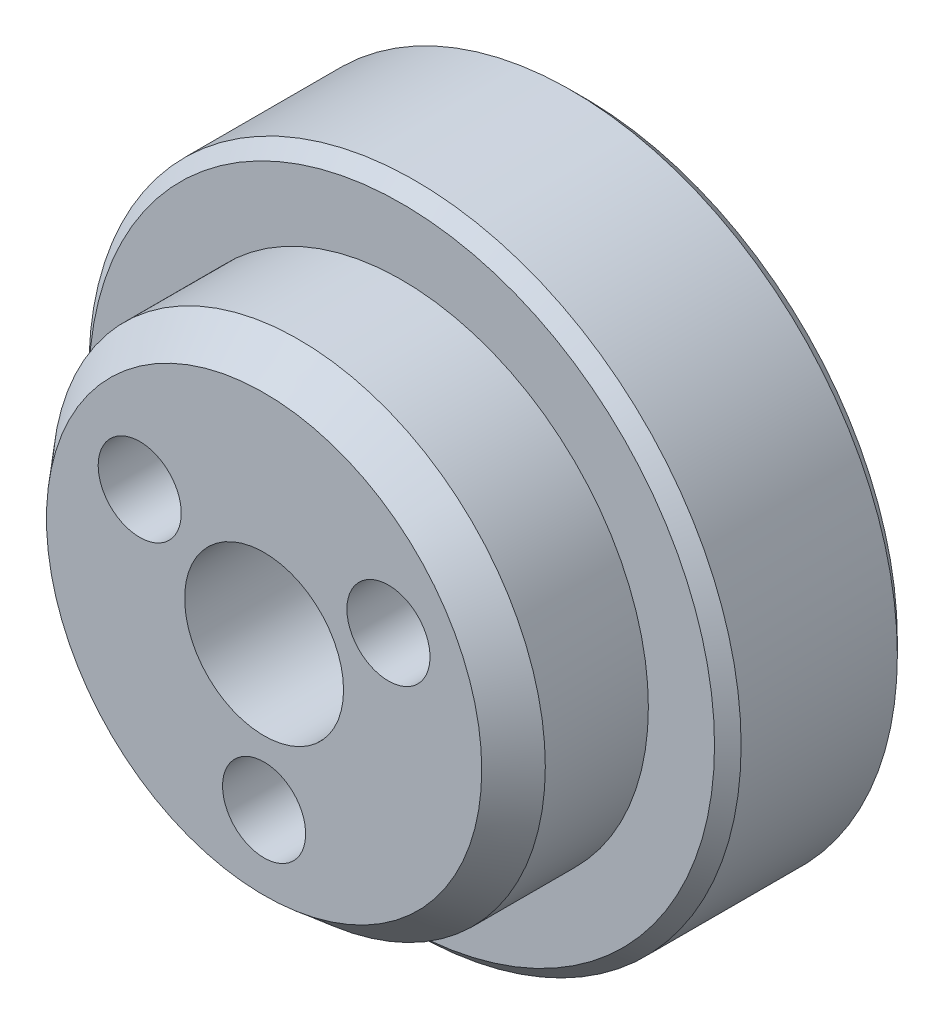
ISO-10303-21;
HEADER;
FILE_DESCRIPTION(('STEP AP214'),'2;1');
FILE_NAME('part.step','',(''),(''),'','','');
FILE_SCHEMA(('AUTOMOTIVE_DESIGN { 1 0 10303 214 1 1 1 1 }'));
ENDSEC;
DATA;
#1=APPLICATION_CONTEXT('core data for automotive mechanical design processes');
#2=APPLICATION_PROTOCOL_DEFINITION('international standard','automotive_design',2000,#1);
#3=PRODUCT_CONTEXT('',#1,'mechanical');
#4=PRODUCT('Part','Part','',(#3));
#5=PRODUCT_RELATED_PRODUCT_CATEGORY('part','',(#4));
#6=PRODUCT_DEFINITION_FORMATION('','',#4);
#7=PRODUCT_DEFINITION_CONTEXT('part definition',#1,'design');
#8=PRODUCT_DEFINITION('design','',#6,#7);
#9=PRODUCT_DEFINITION_SHAPE('','',#8);
#10=(LENGTH_UNIT() NAMED_UNIT(*) SI_UNIT(.MILLI.,.METRE.));
#11=(NAMED_UNIT(*) PLANE_ANGLE_UNIT() SI_UNIT($,.RADIAN.));
#12=(NAMED_UNIT(*) SI_UNIT($,.STERADIAN.) SOLID_ANGLE_UNIT());
#13=UNCERTAINTY_MEASURE_WITH_UNIT(LENGTH_MEASURE(1.E-05),#10,'distance_accuracy_value','');
#14=(GEOMETRIC_REPRESENTATION_CONTEXT(3) GLOBAL_UNCERTAINTY_ASSIGNED_CONTEXT((#13)) GLOBAL_UNIT_ASSIGNED_CONTEXT((#10,
#11,#12)) REPRESENTATION_CONTEXT('',''));
#15=CARTESIAN_POINT('',(0.,0.,0.));
#16=DIRECTION('',(0.,0.,1.));
#17=DIRECTION('',(1.,0.,0.));
#18=AXIS2_PLACEMENT_3D('',#15,#16,#17);
#19=CARTESIAN_POINT('',(0.,0.,12.2428));
#20=DIRECTION('',(0.,0.,-1.));
#21=DIRECTION('',(-1.,0.,0.));
#22=AXIS2_PLACEMENT_3D('',#19,#20,#21);
#23=CYLINDRICAL_SURFACE('',#22,12.4587);
#24=CARTESIAN_POINT('',(0.,0.,6.47699999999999));
#25=DIRECTION('',(0.,0.,1.));
#26=DIRECTION('',(1.,0.,0.));
#27=AXIS2_PLACEMENT_3D('',#24,#25,#26);
#28=CIRCLE('',#27,12.4587);
#29=CARTESIAN_POINT('',(12.4587,0.,6.47699999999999));
#30=VERTEX_POINT('',#29);
#31=EDGE_CURVE('E51',#30,#30,#28,.F.);
#32=ORIENTED_EDGE('',*,*,#31,.T.);
#33=EDGE_LOOP('',(#32));
#34=FACE_BOUND('',#33,.T.);
#35=CARTESIAN_POINT('',(0.,0.,0.508000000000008));
#36=DIRECTION('',(0.,0.,1.));
#37=DIRECTION('',(1.,0.,0.));
#38=AXIS2_PLACEMENT_3D('',#35,#36,#37);
#39=CIRCLE('',#38,12.4587);
#40=CARTESIAN_POINT('',(12.4587,0.,0.508000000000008));
#41=VERTEX_POINT('',#40);
#42=EDGE_CURVE('E55',#41,#41,#39,.T.);
#43=ORIENTED_EDGE('',*,*,#42,.T.);
#44=EDGE_LOOP('',(#43));
#45=FACE_BOUND('',#44,.T.);
#46=ADVANCED_FACE('F44',(#34,#45),#23,.T.);
#47=CARTESIAN_POINT('',(0.,0.,0.));
#48=DIRECTION('',(0.,0.,1.));
#49=DIRECTION('',(1.,0.,0.));
#50=AXIS2_PLACEMENT_3D('',#47,#48,#49);
#51=PLANE('',#50);
#52=CARTESIAN_POINT('',(0.,0.,0.));
#53=DIRECTION('',(0.,0.,1.));
#54=DIRECTION('',(1.,0.,0.));
#55=AXIS2_PLACEMENT_3D('',#52,#53,#54);
#56=CIRCLE('',#55,11.9507);
#57=CARTESIAN_POINT('',(11.9507,0.,0.));
#58=VERTEX_POINT('',#57);
#59=EDGE_CURVE('E13',#58,#58,#56,.F.);
#60=ORIENTED_EDGE('',*,*,#59,.T.);
#61=EDGE_LOOP('',(#60));
#62=FACE_BOUND('',#61,.T.);
#63=CARTESIAN_POINT('',(4.75136177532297,2.74319999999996,0.));
#64=DIRECTION('',(0.,0.,-1.));
#65=DIRECTION('',(0.499999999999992,-0.866025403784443,0.));
#66=AXIS2_PLACEMENT_3D('',#63,#64,#65);
#67=CIRCLE('',#66,1.5875);
#68=CARTESIAN_POINT('',(5.54511177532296,1.36838467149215,0.));
#69=VERTEX_POINT('',#68);
#70=EDGE_CURVE('E104',#69,#69,#67,.T.);
#71=ORIENTED_EDGE('',*,*,#70,.F.);
#72=EDGE_LOOP('',(#71));
#73=FACE_BOUND('',#72,.T.);
#74=CARTESIAN_POINT('',(-4.75136177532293,2.74320000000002,0.));
#75=DIRECTION('',(0.,0.,-1.));
#76=DIRECTION('',(0.500000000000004,0.866025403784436,0.));
#77=AXIS2_PLACEMENT_3D('',#74,#75,#76);
#78=CIRCLE('',#77,1.5875);
#79=CARTESIAN_POINT('',(-3.95761177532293,4.11801532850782,0.));
#80=VERTEX_POINT('',#79);
#81=EDGE_CURVE('E98',#80,#80,#78,.T.);
#82=ORIENTED_EDGE('',*,*,#81,.F.);
#83=EDGE_LOOP('',(#82));
#84=FACE_BOUND('',#83,.T.);
#85=CARTESIAN_POINT('',(0.,-5.4864,0.));
#86=DIRECTION('',(0.,0.,-1.));
#87=DIRECTION('',(-1.,0.,0.));
#88=AXIS2_PLACEMENT_3D('',#85,#86,#87);
#89=CIRCLE('',#88,1.5875);
#90=CARTESIAN_POINT('',(-1.5875,-5.4864,0.));
#91=VERTEX_POINT('',#90);
#92=EDGE_CURVE('E92',#91,#91,#89,.T.);
#93=ORIENTED_EDGE('',*,*,#92,.F.);
#94=EDGE_LOOP('',(#93));
#95=FACE_BOUND('',#94,.T.);
#96=CARTESIAN_POINT('',(0.,7.0104,0.));
#97=DIRECTION('',(0.,0.,-1.));
#98=DIRECTION('',(-1.,0.,0.));
#99=AXIS2_PLACEMENT_3D('',#96,#97,#98);
#100=CIRCLE('',#99,1.6002);
#101=CARTESIAN_POINT('',(-1.6002,7.0104,0.));
#102=VERTEX_POINT('',#101);
#103=EDGE_CURVE('E86',#102,#102,#100,.T.);
#104=ORIENTED_EDGE('',*,*,#103,.F.);
#105=EDGE_LOOP('',(#104));
#106=FACE_BOUND('',#105,.T.);
#107=CARTESIAN_POINT('',(0.,0.,0.));
#108=DIRECTION('',(0.,0.,-1.));
#109=DIRECTION('',(-1.,0.,0.));
#110=AXIS2_PLACEMENT_3D('',#107,#108,#109);
#111=CIRCLE('',#110,1.1684);
#112=CARTESIAN_POINT('',(-1.1684,0.,0.));
#113=VERTEX_POINT('',#112);
#114=EDGE_CURVE('E69',#113,#113,#111,.T.);
#115=ORIENTED_EDGE('',*,*,#114,.F.);
#116=EDGE_LOOP('',(#115));
#117=FACE_BOUND('',#116,.T.);
#118=ADVANCED_FACE('F121',(#62,#73,#84,#95,#106,#117),#51,.F.);
#119=CARTESIAN_POINT('',(0.,0.,6.985));
#120=DIRECTION('',(0.,0.,1.));
#121=DIRECTION('',(1.,0.,0.));
#122=AXIS2_PLACEMENT_3D('',#119,#120,#121);
#123=PLANE('',#122);
#124=CARTESIAN_POINT('',(0.,0.,6.985));
#125=DIRECTION('',(0.,0.,1.));
#126=DIRECTION('',(1.,0.,0.));
#127=AXIS2_PLACEMENT_3D('',#124,#125,#126);
#128=CIRCLE('',#127,11.9507);
#129=CARTESIAN_POINT('',(11.9507,0.,6.985));
#130=VERTEX_POINT('',#129);
#131=EDGE_CURVE('E59',#130,#130,#128,.T.);
#132=ORIENTED_EDGE('',*,*,#131,.T.);
#133=EDGE_LOOP('',(#132));
#134=FACE_BOUND('',#133,.T.);
#135=CARTESIAN_POINT('',(0.,0.,6.985));
#136=DIRECTION('',(0.,0.,1.));
#137=DIRECTION('',(1.,0.,0.));
#138=AXIS2_PLACEMENT_3D('',#135,#136,#137);
#139=CIRCLE('',#138,9.4234);
#140=CARTESIAN_POINT('',(9.4234,0.,6.985));
#141=VERTEX_POINT('',#140);
#142=EDGE_CURVE('E75',#141,#141,#139,.T.);
#143=ORIENTED_EDGE('',*,*,#142,.F.);
#144=EDGE_LOOP('',(#143));
#145=FACE_BOUND('',#144,.T.);
#146=ADVANCED_FACE('F124',(#134,#145),#123,.T.);
#147=CARTESIAN_POINT('',(0.,0.,6.985));
#148=DIRECTION('',(0.,0.,1.));
#149=DIRECTION('',(1.,0.,0.));
#150=AXIS2_PLACEMENT_3D('',#147,#148,#149);
#151=CYLINDRICAL_SURFACE('',#150,9.4234);
#152=CARTESIAN_POINT('',(0.,0.,10.922));
#153=DIRECTION('',(0.,0.,1.));
#154=DIRECTION('',(1.,0.,0.));
#155=AXIS2_PLACEMENT_3D('',#152,#153,#154);
#156=CIRCLE('',#155,9.4234);
#157=CARTESIAN_POINT('',(9.4234,0.,10.922));
#158=VERTEX_POINT('',#157);
#159=EDGE_CURVE('E64',#158,#158,#156,.F.);
#160=ORIENTED_EDGE('',*,*,#159,.T.);
#161=EDGE_LOOP('',(#160));
#162=FACE_BOUND('',#161,.T.);
#163=ORIENTED_EDGE('',*,*,#142,.T.);
#164=EDGE_LOOP('',(#163));
#165=FACE_BOUND('',#164,.T.);
#166=ADVANCED_FACE('F171',(#162,#165),#151,.T.);
#167=CARTESIAN_POINT('',(0.,0.,12.2428));
#168=DIRECTION('',(0.,0.,1.));
#169=DIRECTION('',(1.,0.,0.));
#170=AXIS2_PLACEMENT_3D('',#167,#168,#169);
#171=PLANE('',#170);
#172=CARTESIAN_POINT('',(4.75136177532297,2.74319999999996,12.2428));
#173=DIRECTION('',(0.,0.,-1.));
#174=DIRECTION('',(0.499999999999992,-0.866025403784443,0.));
#175=AXIS2_PLACEMENT_3D('',#172,#173,#174);
#176=CIRCLE('',#175,1.5875);
#177=CARTESIAN_POINT('',(5.54511177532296,1.36838467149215,12.2428));
#178=VERTEX_POINT('',#177);
#179=EDGE_CURVE('E101',#178,#178,#176,.T.);
#180=ORIENTED_EDGE('',*,*,#179,.T.);
#181=EDGE_LOOP('',(#180));
#182=FACE_BOUND('',#181,.T.);
#183=CARTESIAN_POINT('',(-4.75136177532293,2.74320000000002,12.2428));
#184=DIRECTION('',(0.,0.,-1.));
#185=DIRECTION('',(0.500000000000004,0.866025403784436,0.));
#186=AXIS2_PLACEMENT_3D('',#183,#184,#185);
#187=CIRCLE('',#186,1.5875);
#188=CARTESIAN_POINT('',(-3.95761177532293,4.11801532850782,12.2428));
#189=VERTEX_POINT('',#188);
#190=EDGE_CURVE('E95',#189,#189,#187,.T.);
#191=ORIENTED_EDGE('',*,*,#190,.T.);
#192=EDGE_LOOP('',(#191));
#193=FACE_BOUND('',#192,.T.);
#194=CARTESIAN_POINT('',(0.,-5.4864,12.2428));
#195=DIRECTION('',(0.,0.,-1.));
#196=DIRECTION('',(-1.,0.,0.));
#197=AXIS2_PLACEMENT_3D('',#194,#195,#196);
#198=CIRCLE('',#197,1.5875);
#199=CARTESIAN_POINT('',(-1.5875,-5.4864,12.2428));
#200=VERTEX_POINT('',#199);
#201=EDGE_CURVE('E89',#200,#200,#198,.T.);
#202=ORIENTED_EDGE('',*,*,#201,.T.);
#203=EDGE_LOOP('',(#202));
#204=FACE_BOUND('',#203,.T.);
#205=CARTESIAN_POINT('',(0.,0.,12.2428));
#206=DIRECTION('',(0.,0.,1.));
#207=DIRECTION('',(1.,0.,0.));
#208=AXIS2_PLACEMENT_3D('',#205,#206,#207);
#209=CIRCLE('',#208,3.0353);
#210=CARTESIAN_POINT('',(3.0353,0.,12.2428));
#211=VERTEX_POINT('',#210);
#212=EDGE_CURVE('E68',#211,#211,#209,.T.);
#213=ORIENTED_EDGE('',*,*,#212,.F.);
#214=EDGE_LOOP('',(#213));
#215=FACE_BOUND('',#214,.T.);
#216=CARTESIAN_POINT('',(0.,0.,12.2428));
#217=DIRECTION('',(0.,0.,1.));
#218=DIRECTION('',(1.,0.,0.));
#219=AXIS2_PLACEMENT_3D('',#216,#217,#218);
#220=CIRCLE('',#219,8.31511720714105);
#221=CARTESIAN_POINT('',(8.31511720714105,0.,12.2428));
#222=VERTEX_POINT('',#221);
#223=EDGE_CURVE('E72',#222,#222,#220,.T.);
#224=ORIENTED_EDGE('',*,*,#223,.T.);
#225=EDGE_LOOP('',(#224));
#226=FACE_BOUND('',#225,.T.);
#227=ADVANCED_FACE('F110',(#182,#193,#204,#215,#226),#171,.T.);
#228=CARTESIAN_POINT('',(0.,0.,12.2428));
#229=DIRECTION('',(0.,0.,-1.));
#230=DIRECTION('',(-1.,0.,0.));
#231=AXIS2_PLACEMENT_3D('',#228,#229,#230);
#232=CONICAL_SURFACE('',#231,8.31511720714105,0.698131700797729);
#233=ORIENTED_EDGE('',*,*,#159,.F.);
#234=EDGE_LOOP('',(#233));
#235=FACE_BOUND('',#234,.T.);
#236=ORIENTED_EDGE('',*,*,#223,.F.);
#237=EDGE_LOOP('',(#236));
#238=FACE_BOUND('',#237,.T.);
#239=ADVANCED_FACE('F157',(#235,#238),#232,.T.);
#240=CARTESIAN_POINT('',(0.,0.,1.5748));
#241=DIRECTION('',(0.,0.,1.));
#242=DIRECTION('',(1.,0.,0.));
#243=AXIS2_PLACEMENT_3D('',#240,#241,#242);
#244=CYLINDRICAL_SURFACE('',#243,3.0353);
#245=CARTESIAN_POINT('',(0.,0.,1.5748));
#246=DIRECTION('',(0.,0.,1.));
#247=DIRECTION('',(1.,0.,0.));
#248=AXIS2_PLACEMENT_3D('',#245,#246,#247);
#249=CIRCLE('',#248,3.0353);
#250=CARTESIAN_POINT('',(3.0353,0.,1.5748));
#251=VERTEX_POINT('',#250);
#252=EDGE_CURVE('E78',#251,#251,#249,.T.);
#253=ORIENTED_EDGE('',*,*,#252,.F.);
#254=EDGE_LOOP('',(#253));
#255=FACE_BOUND('',#254,.T.);
#256=ORIENTED_EDGE('',*,*,#212,.T.);
#257=EDGE_LOOP('',(#256));
#258=FACE_BOUND('',#257,.T.);
#259=ADVANCED_FACE('F147',(#255,#258),#244,.F.);
#260=CARTESIAN_POINT('',(0.,0.,1.5748));
#261=DIRECTION('',(0.,0.,1.));
#262=DIRECTION('',(1.,0.,0.));
#263=AXIS2_PLACEMENT_3D('',#260,#261,#262);
#264=PLANE('',#263);
#265=CARTESIAN_POINT('',(0.,0.,1.5748));
#266=DIRECTION('',(0.,0.,1.));
#267=DIRECTION('',(1.,0.,0.));
#268=AXIS2_PLACEMENT_3D('',#265,#266,#267);
#269=CIRCLE('',#268,1.1684);
#270=CARTESIAN_POINT('',(-1.1684,0.,1.5748));
#271=VERTEX_POINT('',#270);
#272=EDGE_CURVE('E65',#271,#271,#269,.T.);
#273=ORIENTED_EDGE('',*,*,#272,.F.);
#274=EDGE_LOOP('',(#273));
#275=FACE_BOUND('',#274,.T.);
#276=ORIENTED_EDGE('',*,*,#252,.T.);
#277=EDGE_LOOP('',(#276));
#278=FACE_BOUND('',#277,.T.);
#279=ADVANCED_FACE('F137',(#275,#278),#264,.T.);
#280=CARTESIAN_POINT('',(0.,0.,3.048));
#281=DIRECTION('',(0.,0.,-1.));
#282=DIRECTION('',(-1.,0.,0.));
#283=AXIS2_PLACEMENT_3D('',#280,#281,#282);
#284=CYLINDRICAL_SURFACE('',#283,1.1684);
#285=CARTESIAN_POINT('',(-1.1684,0.,1.5748));
#286=CARTESIAN_POINT('',(-1.1684,0.,1.55839583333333));
#287=CARTESIAN_POINT('',(-1.1684,0.,1.54199166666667));
#288=CARTESIAN_POINT('',(-1.1684,0.,1.50918333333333));
#289=CARTESIAN_POINT('',(-1.1684,0.,1.49277916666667));
#290=CARTESIAN_POINT('',(-1.1684,0.,1.45997083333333));
#291=CARTESIAN_POINT('',(-1.1684,0.,1.44356666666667));
#292=CARTESIAN_POINT('',(-1.1684,0.,1.41075833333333));
#293=CARTESIAN_POINT('',(-1.1684,0.,1.39435416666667));
#294=CARTESIAN_POINT('',(-1.1684,0.,1.36154583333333));
#295=CARTESIAN_POINT('',(-1.1684,0.,1.34514166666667));
#296=CARTESIAN_POINT('',(-1.1684,0.,1.31233333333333));
#297=CARTESIAN_POINT('',(-1.1684,0.,1.29592916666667));
#298=CARTESIAN_POINT('',(-1.1684,0.,1.26312083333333));
#299=CARTESIAN_POINT('',(-1.1684,0.,1.24671666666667));
#300=CARTESIAN_POINT('',(-1.1684,0.,1.21390833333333));
#301=CARTESIAN_POINT('',(-1.1684,0.,1.19750416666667));
#302=CARTESIAN_POINT('',(-1.1684,0.,1.16469583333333));
#303=CARTESIAN_POINT('',(-1.1684,0.,1.14829166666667));
#304=CARTESIAN_POINT('',(-1.1684,0.,1.11548333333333));
#305=CARTESIAN_POINT('',(-1.1684,0.,1.09907916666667));
#306=CARTESIAN_POINT('',(-1.1684,0.,1.06627083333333));
#307=CARTESIAN_POINT('',(-1.1684,0.,1.04986666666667));
#308=CARTESIAN_POINT('',(-1.1684,0.,1.01705833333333));
#309=CARTESIAN_POINT('',(-1.1684,0.,1.00065416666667));
#310=CARTESIAN_POINT('',(-1.1684,0.,0.967845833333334));
#311=CARTESIAN_POINT('',(-1.1684,0.,0.951441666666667));
#312=CARTESIAN_POINT('',(-1.1684,0.,0.918633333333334));
#313=CARTESIAN_POINT('',(-1.1684,0.,0.902229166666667));
#314=CARTESIAN_POINT('',(-1.1684,0.,0.869420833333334));
#315=CARTESIAN_POINT('',(-1.1684,0.,0.853016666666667));
#316=CARTESIAN_POINT('',(-1.1684,0.,0.820208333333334));
#317=CARTESIAN_POINT('',(-1.1684,0.,0.803804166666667));
#318=CARTESIAN_POINT('',(-1.1684,0.,0.770995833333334));
#319=CARTESIAN_POINT('',(-1.1684,0.,0.754591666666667));
#320=CARTESIAN_POINT('',(-1.1684,0.,0.721783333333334));
#321=CARTESIAN_POINT('',(-1.1684,0.,0.705379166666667));
#322=CARTESIAN_POINT('',(-1.1684,0.,0.672570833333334));
#323=CARTESIAN_POINT('',(-1.1684,0.,0.656166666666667));
#324=CARTESIAN_POINT('',(-1.1684,0.,0.623358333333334));
#325=CARTESIAN_POINT('',(-1.1684,0.,0.606954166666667));
#326=CARTESIAN_POINT('',(-1.1684,0.,0.574145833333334));
#327=CARTESIAN_POINT('',(-1.1684,0.,0.557741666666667));
#328=CARTESIAN_POINT('',(-1.1684,0.,0.524933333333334));
#329=CARTESIAN_POINT('',(-1.1684,0.,0.508529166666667));
#330=CARTESIAN_POINT('',(-1.1684,0.,0.475720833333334));
#331=CARTESIAN_POINT('',(-1.1684,0.,0.459316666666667));
#332=CARTESIAN_POINT('',(-1.1684,0.,0.426508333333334));
#333=CARTESIAN_POINT('',(-1.1684,0.,0.410104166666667));
#334=CARTESIAN_POINT('',(-1.1684,0.,0.377295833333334));
#335=CARTESIAN_POINT('',(-1.1684,0.,0.360891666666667));
#336=CARTESIAN_POINT('',(-1.1684,0.,0.328083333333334));
#337=CARTESIAN_POINT('',(-1.1684,0.,0.311679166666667));
#338=CARTESIAN_POINT('',(-1.1684,0.,0.278870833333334));
#339=CARTESIAN_POINT('',(-1.1684,0.,0.262466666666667));
#340=CARTESIAN_POINT('',(-1.1684,0.,0.229658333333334));
#341=CARTESIAN_POINT('',(-1.1684,0.,0.213254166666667));
#342=CARTESIAN_POINT('',(-1.1684,0.,0.180445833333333));
#343=CARTESIAN_POINT('',(-1.1684,0.,0.164041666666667));
#344=CARTESIAN_POINT('',(-1.1684,0.,0.131233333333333));
#345=CARTESIAN_POINT('',(-1.1684,0.,0.114829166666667));
#346=CARTESIAN_POINT('',(-1.1684,0.,0.0820208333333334));
#347=CARTESIAN_POINT('',(-1.1684,0.,0.0656166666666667));
#348=CARTESIAN_POINT('',(-1.1684,0.,0.0328083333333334));
#349=CARTESIAN_POINT('',(-1.1684,0.,0.0164041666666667));
#350=CARTESIAN_POINT('',(-1.1684,0.,0.));
#351=B_SPLINE_CURVE_WITH_KNOTS('',3,(#285,#286,#287,#288,#289,#290,#291,#292,#293,#294,#295,
#296,#297,#298,#299,#300,#301,#302,#303,#304,#305,#306,#307,#308,#309,#310,#311,#312,#313,#314,
#315,#316,#317,#318,#319,#320,#321,#322,#323,#324,#325,#326,#327,#328,#329,#330,#331,#332,#333,
#334,#335,#336,#337,#338,#339,#340,#341,#342,#343,#344,#345,#346,#347,#348,#349,#350),
.UNSPECIFIED.,.F.,.F.,(4,2,2,2,2,2,2,2,2,2,2,2,2,2,2,2,2,2,2,2,2,2,2,2,2,2,2,2,2,2,2,2,4),(0.,
0.0492125,0.0984250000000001,0.1476375,0.19685,0.2460625,0.295275,0.3444875,0.3937,0.4429125,
0.492125,0.5413375,0.59055,0.6397625,0.688975,0.7381875,0.7874,0.8366125,0.885825,
0.935037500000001,0.984250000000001,1.0334625,1.082675,1.1318875,1.1811,1.2303125,1.279525,
1.3287375,1.37795,1.4271625,1.476375,1.5255875,1.5748),.UNSPECIFIED.);
#352=EDGE_CURVE('BSEAM134',#271,#113,#351,.T.);
#353=ORIENTED_EDGE('',*,*,#272,.T.);
#354=ORIENTED_EDGE('',*,*,#114,.T.);
#355=ORIENTED_EDGE('',*,*,#352,.T.);
#356=ORIENTED_EDGE('',*,*,#352,.F.);
#357=EDGE_LOOP('',(#353,#355,#354,#356));
#358=FACE_BOUND('',#357,.T.);
#359=ADVANCED_FACE('F134',(#358),#284,.F.);
#360=CARTESIAN_POINT('',(0.,7.0104,3.048));
#361=DIRECTION('',(0.,0.,-1.));
#362=DIRECTION('',(-1.,0.,0.));
#363=AXIS2_PLACEMENT_3D('',#360,#361,#362);
#364=CYLINDRICAL_SURFACE('',#363,1.6002);
#365=CARTESIAN_POINT('',(0.,7.0104,3.048));
#366=DIRECTION('',(0.,0.,-1.));
#367=DIRECTION('',(-1.,0.,0.));
#368=AXIS2_PLACEMENT_3D('',#365,#366,#367);
#369=CIRCLE('',#368,1.6002);
#370=CARTESIAN_POINT('',(-1.6002,7.0104,3.048));
#371=VERTEX_POINT('',#370);
#372=EDGE_CURVE('E85',#371,#371,#369,.T.);
#373=CARTESIAN_POINT('',(-1.6002,7.0104,3.048));
#374=CARTESIAN_POINT('',(-1.6002,7.0104,3.01625));
#375=CARTESIAN_POINT('',(-1.6002,7.0104,2.9845));
#376=CARTESIAN_POINT('',(-1.6002,7.0104,2.921));
#377=CARTESIAN_POINT('',(-1.6002,7.0104,2.88925));
#378=CARTESIAN_POINT('',(-1.6002,7.0104,2.82575));
#379=CARTESIAN_POINT('',(-1.6002,7.0104,2.794));
#380=CARTESIAN_POINT('',(-1.6002,7.0104,2.7305));
#381=CARTESIAN_POINT('',(-1.6002,7.0104,2.69875));
#382=CARTESIAN_POINT('',(-1.6002,7.0104,2.63525));
#383=CARTESIAN_POINT('',(-1.6002,7.0104,2.6035));
#384=CARTESIAN_POINT('',(-1.6002,7.0104,2.54));
#385=CARTESIAN_POINT('',(-1.6002,7.0104,2.50825));
#386=CARTESIAN_POINT('',(-1.6002,7.0104,2.44475));
#387=CARTESIAN_POINT('',(-1.6002,7.0104,2.413));
#388=CARTESIAN_POINT('',(-1.6002,7.0104,2.3495));
#389=CARTESIAN_POINT('',(-1.6002,7.0104,2.31775));
#390=CARTESIAN_POINT('',(-1.6002,7.0104,2.25425));
#391=CARTESIAN_POINT('',(-1.6002,7.0104,2.2225));
#392=CARTESIAN_POINT('',(-1.6002,7.0104,2.159));
#393=CARTESIAN_POINT('',(-1.6002,7.0104,2.12725));
#394=CARTESIAN_POINT('',(-1.6002,7.0104,2.06375));
#395=CARTESIAN_POINT('',(-1.6002,7.0104,2.032));
#396=CARTESIAN_POINT('',(-1.6002,7.0104,1.9685));
#397=CARTESIAN_POINT('',(-1.6002,7.0104,1.93675));
#398=CARTESIAN_POINT('',(-1.6002,7.0104,1.87325));
#399=CARTESIAN_POINT('',(-1.6002,7.0104,1.8415));
#400=CARTESIAN_POINT('',(-1.6002,7.0104,1.778));
#401=CARTESIAN_POINT('',(-1.6002,7.0104,1.74625));
#402=CARTESIAN_POINT('',(-1.6002,7.0104,1.68275));
#403=CARTESIAN_POINT('',(-1.6002,7.0104,1.651));
#404=CARTESIAN_POINT('',(-1.6002,7.0104,1.5875));
#405=CARTESIAN_POINT('',(-1.6002,7.0104,1.55575));
#406=CARTESIAN_POINT('',(-1.6002,7.0104,1.49225));
#407=CARTESIAN_POINT('',(-1.6002,7.0104,1.4605));
#408=CARTESIAN_POINT('',(-1.6002,7.0104,1.397));
#409=CARTESIAN_POINT('',(-1.6002,7.0104,1.36525));
#410=CARTESIAN_POINT('',(-1.6002,7.0104,1.30175));
#411=CARTESIAN_POINT('',(-1.6002,7.0104,1.27));
#412=CARTESIAN_POINT('',(-1.6002,7.0104,1.2065));
#413=CARTESIAN_POINT('',(-1.6002,7.0104,1.17475));
#414=CARTESIAN_POINT('',(-1.6002,7.0104,1.11125));
#415=CARTESIAN_POINT('',(-1.6002,7.0104,1.0795));
#416=CARTESIAN_POINT('',(-1.6002,7.0104,1.016));
#417=CARTESIAN_POINT('',(-1.6002,7.0104,0.98425));
#418=CARTESIAN_POINT('',(-1.6002,7.0104,0.92075));
#419=CARTESIAN_POINT('',(-1.6002,7.0104,0.889));
#420=CARTESIAN_POINT('',(-1.6002,7.0104,0.8255));
#421=CARTESIAN_POINT('',(-1.6002,7.0104,0.79375));
#422=CARTESIAN_POINT('',(-1.6002,7.0104,0.73025));
#423=CARTESIAN_POINT('',(-1.6002,7.0104,0.6985));
#424=CARTESIAN_POINT('',(-1.6002,7.0104,0.635));
#425=CARTESIAN_POINT('',(-1.6002,7.0104,0.60325));
#426=CARTESIAN_POINT('',(-1.6002,7.0104,0.53975));
#427=CARTESIAN_POINT('',(-1.6002,7.0104,0.508));
#428=CARTESIAN_POINT('',(-1.6002,7.0104,0.4445));
#429=CARTESIAN_POINT('',(-1.6002,7.0104,0.41275));
#430=CARTESIAN_POINT('',(-1.6002,7.0104,0.34925));
#431=CARTESIAN_POINT('',(-1.6002,7.0104,0.3175));
#432=CARTESIAN_POINT('',(-1.6002,7.0104,0.254));
#433=CARTESIAN_POINT('',(-1.6002,7.0104,0.22225));
#434=CARTESIAN_POINT('',(-1.6002,7.0104,0.15875));
#435=CARTESIAN_POINT('',(-1.6002,7.0104,0.127));
#436=CARTESIAN_POINT('',(-1.6002,7.0104,0.0634999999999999));
#437=CARTESIAN_POINT('',(-1.6002,7.0104,0.03175));
#438=CARTESIAN_POINT('',(-1.6002,7.0104,0.));
#439=B_SPLINE_CURVE_WITH_KNOTS('',3,(#373,#374,#375,#376,#377,#378,#379,#380,#381,#382,#383,
#384,#385,#386,#387,#388,#389,#390,#391,#392,#393,#394,#395,#396,#397,#398,#399,#400,#401,#402,
#403,#404,#405,#406,#407,#408,#409,#410,#411,#412,#413,#414,#415,#416,#417,#418,#419,#420,#421,
#422,#423,#424,#425,#426,#427,#428,#429,#430,#431,#432,#433,#434,#435,#436,#437,#438),
.UNSPECIFIED.,.F.,.F.,(4,2,2,2,2,2,2,2,2,2,2,2,2,2,2,2,2,2,2,2,2,2,2,2,2,2,2,2,2,2,2,2,4),(0.,
0.0952499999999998,0.1905,0.28575,0.381,0.47625,0.5715,0.66675,0.762,0.85725,0.9525,1.04775,
1.143,1.23825,1.3335,1.42875,1.524,1.61925,1.7145,1.80975,1.905,2.00025,2.0955,2.19075,2.286,
2.38125,2.4765,2.57175,2.667,2.76225,2.8575,2.95275,3.048),.UNSPECIFIED.);
#440=EDGE_CURVE('BSEAM136',#371,#102,#439,.T.);
#441=ORIENTED_EDGE('',*,*,#372,.F.);
#442=ORIENTED_EDGE('',*,*,#103,.T.);
#443=ORIENTED_EDGE('',*,*,#440,.T.);
#444=ORIENTED_EDGE('',*,*,#440,.F.);
#445=EDGE_LOOP('',(#441,#443,#442,#444));
#446=FACE_BOUND('',#445,.T.);
#447=ADVANCED_FACE('F136',(#446),#364,.F.);
#448=CARTESIAN_POINT('',(0.,7.0104,3.048));
#449=DIRECTION('',(0.,0.,-1.));
#450=DIRECTION('',(-1.,0.,0.));
#451=AXIS2_PLACEMENT_3D('',#448,#449,#450);
#452=PLANE('',#451);
#453=ORIENTED_EDGE('',*,*,#372,.T.);
#454=EDGE_LOOP('',(#453));
#455=FACE_BOUND('',#454,.T.);
#456=ADVANCED_FACE('F144',(#455),#452,.T.);
#457=CARTESIAN_POINT('',(0.,-5.4864,12.2428));
#458=DIRECTION('',(0.,0.,-1.));
#459=DIRECTION('',(-1.,0.,0.));
#460=AXIS2_PLACEMENT_3D('',#457,#458,#459);
#461=CYLINDRICAL_SURFACE('',#460,1.5875);
#462=ORIENTED_EDGE('',*,*,#201,.F.);
#463=EDGE_LOOP('',(#462));
#464=FACE_BOUND('',#463,.T.);
#465=ORIENTED_EDGE('',*,*,#92,.T.);
#466=EDGE_LOOP('',(#465));
#467=FACE_BOUND('',#466,.T.);
#468=ADVANCED_FACE('F219',(#464,#467),#461,.F.);
#469=CARTESIAN_POINT('',(-4.75136177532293,2.74320000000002,12.2428));
#470=DIRECTION('',(0.,0.,-1.));
#471=DIRECTION('',(-1.,0.,0.));
#472=AXIS2_PLACEMENT_3D('',#469,#470,#471);
#473=CYLINDRICAL_SURFACE('',#472,1.5875);
#474=ORIENTED_EDGE('',*,*,#190,.F.);
#475=EDGE_LOOP('',(#474));
#476=FACE_BOUND('',#475,.T.);
#477=ORIENTED_EDGE('',*,*,#81,.T.);
#478=EDGE_LOOP('',(#477));
#479=FACE_BOUND('',#478,.T.);
#480=ADVANCED_FACE('F117',(#476,#479),#473,.F.);
#481=CARTESIAN_POINT('',(4.75136177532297,2.74319999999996,12.2428));
#482=DIRECTION('',(0.,0.,-1.));
#483=DIRECTION('',(-1.,0.,0.));
#484=AXIS2_PLACEMENT_3D('',#481,#482,#483);
#485=CYLINDRICAL_SURFACE('',#484,1.5875);
#486=ORIENTED_EDGE('',*,*,#179,.F.);
#487=EDGE_LOOP('',(#486));
#488=FACE_BOUND('',#487,.T.);
#489=ORIENTED_EDGE('',*,*,#70,.T.);
#490=EDGE_LOOP('',(#489));
#491=FACE_BOUND('',#490,.T.);
#492=ADVANCED_FACE('F113',(#488,#491),#485,.F.);
#493=CARTESIAN_POINT('',(0.,0.,6.985));
#494=DIRECTION('',(0.,0.,-1.));
#495=DIRECTION('',(-1.,0.,0.));
#496=AXIS2_PLACEMENT_3D('',#493,#494,#495);
#497=CONICAL_SURFACE('',#496,11.9507,0.785398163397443);
#498=ORIENTED_EDGE('',*,*,#31,.F.);
#499=EDGE_LOOP('',(#498));
#500=FACE_BOUND('',#499,.T.);
#501=ORIENTED_EDGE('',*,*,#131,.F.);
#502=EDGE_LOOP('',(#501));
#503=FACE_BOUND('',#502,.T.);
#504=ADVANCED_FACE('F116',(#500,#503),#497,.T.);
#505=CARTESIAN_POINT('',(0.,0.,0.508000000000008));
#506=DIRECTION('',(0.,0.,1.));
#507=DIRECTION('',(1.,0.,0.));
#508=AXIS2_PLACEMENT_3D('',#505,#506,#507);
#509=CONICAL_SURFACE('',#508,12.4587,0.785398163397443);
#510=ORIENTED_EDGE('',*,*,#59,.F.);
#511=EDGE_LOOP('',(#510));
#512=FACE_BOUND('',#511,.T.);
#513=ORIENTED_EDGE('',*,*,#42,.F.);
#514=EDGE_LOOP('',(#513));
#515=FACE_BOUND('',#514,.T.);
#516=ADVANCED_FACE('F46',(#512,#515),#509,.T.);
#517=CLOSED_SHELL('',(#46,#118,#146,#166,#227,#239,#259,#279,#359,#447,#456,#468,#480,#492,#504,#516));
#518=MANIFOLD_SOLID_BREP('B2',#517);
#519=ADVANCED_BREP_SHAPE_REPRESENTATION('',(#18,#518),#14);
#520=SHAPE_DEFINITION_REPRESENTATION(#9,#519);
ENDSEC;
END-ISO-10303-21;
